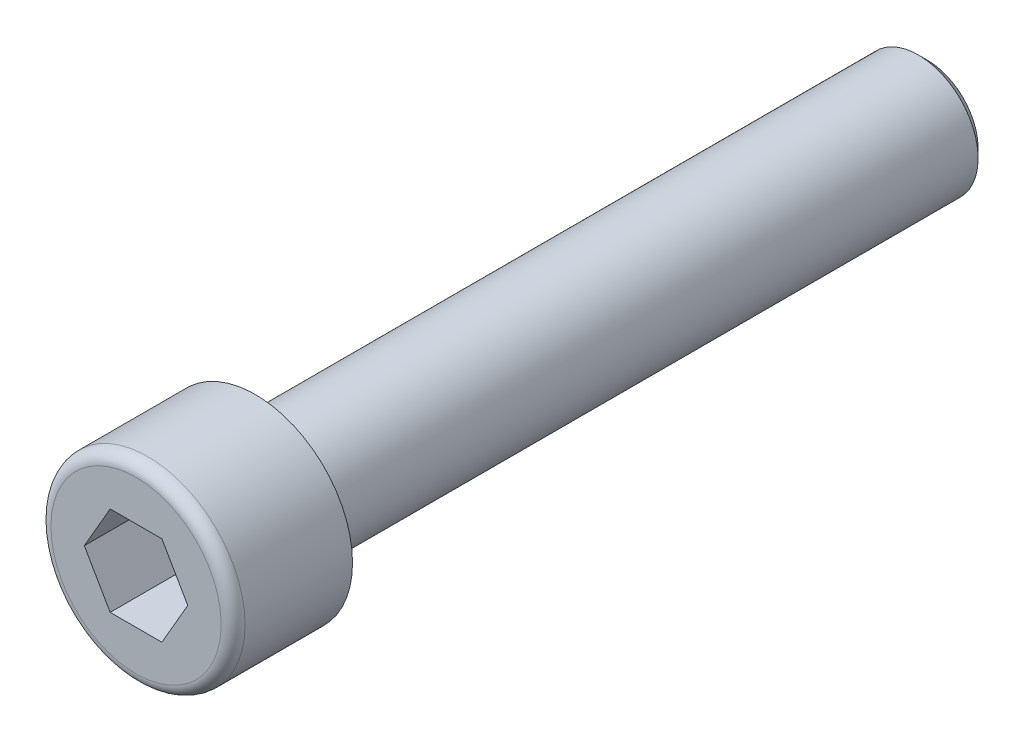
ISO-10303-21;
HEADER;
FILE_DESCRIPTION(('STEP AP214'),'2;1');
FILE_NAME('part.step','',(''),(''),'','','');
FILE_SCHEMA(('AUTOMOTIVE_DESIGN { 1 0 10303 214 1 1 1 1 }'));
ENDSEC;
DATA;
#1=APPLICATION_CONTEXT('core data for automotive mechanical design processes');
#2=APPLICATION_PROTOCOL_DEFINITION('international standard','automotive_design',2000,#1);
#3=PRODUCT_CONTEXT('',#1,'mechanical');
#4=PRODUCT('Part','Part','',(#3));
#5=PRODUCT_RELATED_PRODUCT_CATEGORY('part','',(#4));
#6=PRODUCT_DEFINITION_FORMATION('','',#4);
#7=PRODUCT_DEFINITION_CONTEXT('part definition',#1,'design');
#8=PRODUCT_DEFINITION('design','',#6,#7);
#9=PRODUCT_DEFINITION_SHAPE('','',#8);
#10=(LENGTH_UNIT() NAMED_UNIT(*) SI_UNIT(.MILLI.,.METRE.));
#11=(NAMED_UNIT(*) PLANE_ANGLE_UNIT() SI_UNIT($,.RADIAN.));
#12=(NAMED_UNIT(*) SI_UNIT($,.STERADIAN.) SOLID_ANGLE_UNIT());
#13=UNCERTAINTY_MEASURE_WITH_UNIT(LENGTH_MEASURE(1.E-05),#10,'distance_accuracy_value','');
#14=(GEOMETRIC_REPRESENTATION_CONTEXT(3) GLOBAL_UNCERTAINTY_ASSIGNED_CONTEXT((#13)) GLOBAL_UNIT_ASSIGNED_CONTEXT((#10,
#11,#12)) REPRESENTATION_CONTEXT('',''));
#15=CARTESIAN_POINT('',(0.,0.,0.));
#16=DIRECTION('',(0.,0.,1.));
#17=DIRECTION('',(1.,0.,0.));
#18=AXIS2_PLACEMENT_3D('',#15,#16,#17);
#19=CARTESIAN_POINT('',(0.,0.,8.));
#20=DIRECTION('',(0.,0.,1.));
#21=DIRECTION('',(1.,0.,0.));
#22=AXIS2_PLACEMENT_3D('',#19,#20,#21);
#23=PLANE('',#22);
#24=DIRECTION('',(0.500000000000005,-0.866025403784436,0.));
#25=VECTOR('',#24,1.);
#26=CARTESIAN_POINT('',(-2.59807621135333,-1.50000000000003,8.));
#27=LINE('',#26,#25);
#28=CARTESIAN_POINT('',(-3.4641016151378,0.,8.));
#29=VERTEX_POINT('',#28);
#30=CARTESIAN_POINT('',(-1.7320508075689,-3.,8.));
#31=VERTEX_POINT('',#30);
#32=EDGE_CURVE('E11',#29,#31,#27,.T.);
#33=ORIENTED_EDGE('',*,*,#32,.F.);
#34=DIRECTION('',(-0.500000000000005,-0.866025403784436,0.));
#35=VECTOR('',#34,1.);
#36=CARTESIAN_POINT('',(-2.59807621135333,1.50000000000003,8.));
#37=LINE('',#36,#35);
#38=CARTESIAN_POINT('',(-1.7320508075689,3.,8.));
#39=VERTEX_POINT('',#38);
#40=EDGE_CURVE('E39',#39,#29,#37,.T.);
#41=ORIENTED_EDGE('',*,*,#40,.F.);
#42=DIRECTION('',(-1.,0.,0.));
#43=VECTOR('',#42,1.);
#44=CARTESIAN_POINT('',(0.,3.,8.));
#45=LINE('',#44,#43);
#46=CARTESIAN_POINT('',(1.7320508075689,3.,8.));
#47=VERTEX_POINT('',#46);
#48=EDGE_CURVE('E147',#47,#39,#45,.T.);
#49=ORIENTED_EDGE('',*,*,#48,.F.);
#50=DIRECTION('',(-0.500000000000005,0.866025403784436,0.));
#51=VECTOR('',#50,1.);
#52=CARTESIAN_POINT('',(2.59807621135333,1.50000000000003,8.));
#53=LINE('',#52,#51);
#54=CARTESIAN_POINT('',(3.4641016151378,0.,8.));
#55=VERTEX_POINT('',#54);
#56=EDGE_CURVE('E145',#55,#47,#53,.T.);
#57=ORIENTED_EDGE('',*,*,#56,.F.);
#58=DIRECTION('',(0.500000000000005,0.866025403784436,0.));
#59=VECTOR('',#58,1.);
#60=CARTESIAN_POINT('',(2.59807621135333,-1.50000000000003,8.));
#61=LINE('',#60,#59);
#62=CARTESIAN_POINT('',(1.7320508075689,-3.,8.));
#63=VERTEX_POINT('',#62);
#64=EDGE_CURVE('E143',#63,#55,#61,.T.);
#65=ORIENTED_EDGE('',*,*,#64,.F.);
#66=DIRECTION('',(1.,0.,0.));
#67=VECTOR('',#66,1.);
#68=CARTESIAN_POINT('',(0.,-3.,8.));
#69=LINE('',#68,#67);
#70=EDGE_CURVE('E141',#31,#63,#69,.T.);
#71=ORIENTED_EDGE('',*,*,#70,.F.);
#72=EDGE_LOOP('',(#33,#41,#49,#57,#65,#71));
#73=FACE_BOUND('',#72,.T.);
#74=CARTESIAN_POINT('',(0.,0.,8.));
#75=DIRECTION('',(0.,0.,-1.));
#76=DIRECTION('',(-1.,0.,0.));
#77=AXIS2_PLACEMENT_3D('',#74,#75,#76);
#78=CIRCLE('',#77,5.7);
#79=CARTESIAN_POINT('',(-5.7,0.,8.));
#80=VERTEX_POINT('',#79);
#81=EDGE_CURVE('E138',#80,#80,#78,.T.);
#82=ORIENTED_EDGE('',*,*,#81,.F.);
#83=EDGE_LOOP('',(#82));
#84=FACE_BOUND('',#83,.T.);
#85=ADVANCED_FACE('F32',(#73,#84),#23,.T.);
#86=CARTESIAN_POINT('',(0.,0.,7.19999999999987));
#87=DIRECTION('',(0.,0.,-1.));
#88=DIRECTION('',(-1.,0.,0.));
#89=AXIS2_PLACEMENT_3D('',#86,#87,#88);
#90=TOROIDAL_SURFACE('',#89,5.69999999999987,0.80000000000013);
#91=ORIENTED_EDGE('',*,*,#81,.T.);
#92=EDGE_LOOP('',(#91));
#93=FACE_BOUND('',#92,.T.);
#94=CARTESIAN_POINT('',(0.,0.,7.2));
#95=DIRECTION('',(0.,0.,-1.));
#96=DIRECTION('',(-1.,0.,0.));
#97=AXIS2_PLACEMENT_3D('',#94,#95,#96);
#98=CIRCLE('',#97,6.5);
#99=CARTESIAN_POINT('',(-6.5,0.,7.2));
#100=VERTEX_POINT('',#99);
#101=EDGE_CURVE('E135',#100,#100,#98,.T.);
#102=ORIENTED_EDGE('',*,*,#101,.F.);
#103=EDGE_LOOP('',(#102));
#104=FACE_BOUND('',#103,.T.);
#105=ADVANCED_FACE('F171',(#93,#104),#90,.T.);
#106=CARTESIAN_POINT('',(0.,0.,-45.));
#107=DIRECTION('',(0.,0.,-1.));
#108=DIRECTION('',(-1.,0.,0.));
#109=AXIS2_PLACEMENT_3D('',#106,#107,#108);
#110=CYLINDRICAL_SURFACE('',#109,6.5);
#111=ORIENTED_EDGE('',*,*,#101,.T.);
#112=EDGE_LOOP('',(#111));
#113=FACE_BOUND('',#112,.T.);
#114=CARTESIAN_POINT('',(0.,0.,0.));
#115=DIRECTION('',(0.,0.,-1.));
#116=DIRECTION('',(-1.,0.,0.));
#117=AXIS2_PLACEMENT_3D('',#114,#115,#116);
#118=CIRCLE('',#117,6.5);
#119=CARTESIAN_POINT('',(-6.5,0.,0.));
#120=VERTEX_POINT('',#119);
#121=EDGE_CURVE('E132',#120,#120,#118,.T.);
#122=ORIENTED_EDGE('',*,*,#121,.F.);
#123=EDGE_LOOP('',(#122));
#124=FACE_BOUND('',#123,.T.);
#125=ADVANCED_FACE('F175',(#113,#124),#110,.T.);
#126=CARTESIAN_POINT('',(0.,6.5,0.));
#127=DIRECTION('',(0.,0.,-1.));
#128=DIRECTION('',(-1.,0.,0.));
#129=AXIS2_PLACEMENT_3D('',#126,#127,#128);
#130=PLANE('',#129);
#131=ORIENTED_EDGE('',*,*,#121,.T.);
#132=EDGE_LOOP('',(#131));
#133=FACE_BOUND('',#132,.T.);
#134=CARTESIAN_POINT('',(0.,0.,0.));
#135=DIRECTION('',(0.,0.,-1.));
#136=DIRECTION('',(-1.,0.,0.));
#137=AXIS2_PLACEMENT_3D('',#134,#135,#136);
#138=CIRCLE('',#137,4.);
#139=CARTESIAN_POINT('',(-4.,0.,0.));
#140=VERTEX_POINT('',#139);
#141=EDGE_CURVE('E129',#140,#140,#138,.T.);
#142=ORIENTED_EDGE('',*,*,#141,.F.);
#143=EDGE_LOOP('',(#142));
#144=FACE_BOUND('',#143,.T.);
#145=ADVANCED_FACE('F180',(#133,#144),#130,.T.);
#146=CARTESIAN_POINT('',(0.,0.,-45.));
#147=DIRECTION('',(0.,0.,-1.));
#148=DIRECTION('',(-1.,0.,0.));
#149=AXIS2_PLACEMENT_3D('',#146,#147,#148);
#150=CYLINDRICAL_SURFACE('',#149,4.);
#151=ORIENTED_EDGE('',*,*,#141,.T.);
#152=EDGE_LOOP('',(#151));
#153=FACE_BOUND('',#152,.T.);
#154=CARTESIAN_POINT('',(0.,0.,-44.4));
#155=DIRECTION('',(0.,0.,-1.));
#156=DIRECTION('',(-1.,0.,0.));
#157=AXIS2_PLACEMENT_3D('',#154,#155,#156);
#158=CIRCLE('',#157,4.);
#159=CARTESIAN_POINT('',(-4.,0.,-44.4));
#160=VERTEX_POINT('',#159);
#161=EDGE_CURVE('E126',#160,#160,#158,.T.);
#162=ORIENTED_EDGE('',*,*,#161,.F.);
#163=EDGE_LOOP('',(#162));
#164=FACE_BOUND('',#163,.T.);
#165=ADVANCED_FACE('F187',(#153,#164),#150,.T.);
#166=CARTESIAN_POINT('',(0.,0.,-45.));
#167=DIRECTION('',(0.,0.,1.));
#168=DIRECTION('',(1.,0.,0.));
#169=AXIS2_PLACEMENT_3D('',#166,#167,#168);
#170=CONICAL_SURFACE('',#169,3.4,0.785398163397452);
#171=ORIENTED_EDGE('',*,*,#161,.T.);
#172=EDGE_LOOP('',(#171));
#173=FACE_BOUND('',#172,.T.);
#174=CARTESIAN_POINT('',(0.,0.,-45.));
#175=DIRECTION('',(0.,0.,-1.));
#176=DIRECTION('',(-1.,0.,0.));
#177=AXIS2_PLACEMENT_3D('',#174,#175,#176);
#178=CIRCLE('',#177,3.4);
#179=CARTESIAN_POINT('',(-3.4,0.,-45.));
#180=VERTEX_POINT('',#179);
#181=EDGE_CURVE('E114',#180,#180,#178,.T.);
#182=ORIENTED_EDGE('',*,*,#181,.F.);
#183=EDGE_LOOP('',(#182));
#184=FACE_BOUND('',#183,.T.);
#185=ADVANCED_FACE('F191',(#173,#184),#170,.T.);
#186=CARTESIAN_POINT('',(0.,3.4,-45.));
#187=DIRECTION('',(0.,0.,-1.));
#188=DIRECTION('',(-1.,0.,0.));
#189=AXIS2_PLACEMENT_3D('',#186,#187,#188);
#190=PLANE('',#189);
#191=ORIENTED_EDGE('',*,*,#181,.T.);
#192=EDGE_LOOP('',(#191));
#193=FACE_BOUND('',#192,.T.);
#194=ADVANCED_FACE('F195',(#193),#190,.T.);
#195=CARTESIAN_POINT('',(-3.4641016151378,0.,3.));
#196=DIRECTION('',(-0.866025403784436,-0.500000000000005,0.));
#197=DIRECTION('',(0.500000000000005,-0.866025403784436,0.));
#198=AXIS2_PLACEMENT_3D('',#195,#196,#197);
#199=PLANE('',#198);
#200=ORIENTED_EDGE('',*,*,#32,.T.);
#201=DIRECTION('',(0.,0.,1.));
#202=VECTOR('',#201,1.);
#203=CARTESIAN_POINT('',(-1.7320508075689,-3.,3.));
#204=LINE('',#203,#202);
#205=CARTESIAN_POINT('',(-1.7320508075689,-3.,3.));
#206=VERTEX_POINT('',#205);
#207=EDGE_CURVE('E46',#206,#31,#204,.T.);
#208=ORIENTED_EDGE('',*,*,#207,.F.);
#209=DIRECTION('',(0.500000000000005,-0.866025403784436,0.));
#210=VECTOR('',#209,1.);
#211=CARTESIAN_POINT('',(-3.4641016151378,0.,3.));
#212=LINE('',#211,#210);
#213=CARTESIAN_POINT('',(-3.4641016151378,0.,3.));
#214=VERTEX_POINT('',#213);
#215=EDGE_CURVE('E84',#214,#206,#212,.T.);
#216=ORIENTED_EDGE('',*,*,#215,.F.);
#217=DIRECTION('',(0.,0.,1.));
#218=VECTOR('',#217,1.);
#219=CARTESIAN_POINT('',(-3.4641016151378,0.,3.));
#220=LINE('',#219,#218);
#221=EDGE_CURVE('E112',#214,#29,#220,.T.);
#222=ORIENTED_EDGE('',*,*,#221,.T.);
#223=EDGE_LOOP('',(#200,#208,#216,#222));
#224=FACE_BOUND('',#223,.T.);
#225=ADVANCED_FACE('F82',(#224),#199,.F.);
#226=CARTESIAN_POINT('',(-1.7320508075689,3.,3.));
#227=DIRECTION('',(-0.866025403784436,0.500000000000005,0.));
#228=DIRECTION('',(-0.500000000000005,-0.866025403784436,0.));
#229=AXIS2_PLACEMENT_3D('',#226,#227,#228);
#230=PLANE('',#229);
#231=ORIENTED_EDGE('',*,*,#40,.T.);
#232=ORIENTED_EDGE('',*,*,#221,.F.);
#233=DIRECTION('',(-0.500000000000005,-0.866025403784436,0.));
#234=VECTOR('',#233,1.);
#235=CARTESIAN_POINT('',(-1.7320508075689,3.,3.));
#236=LINE('',#235,#234);
#237=CARTESIAN_POINT('',(-1.7320508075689,3.,3.));
#238=VERTEX_POINT('',#237);
#239=EDGE_CURVE('E89',#238,#214,#236,.T.);
#240=ORIENTED_EDGE('',*,*,#239,.F.);
#241=DIRECTION('',(0.,0.,1.));
#242=VECTOR('',#241,1.);
#243=CARTESIAN_POINT('',(-1.7320508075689,3.,3.));
#244=LINE('',#243,#242);
#245=EDGE_CURVE('E115',#238,#39,#244,.T.);
#246=ORIENTED_EDGE('',*,*,#245,.T.);
#247=EDGE_LOOP('',(#231,#232,#240,#246));
#248=FACE_BOUND('',#247,.T.);
#249=ADVANCED_FACE('F154',(#248),#230,.F.);
#250=CARTESIAN_POINT('',(1.7320508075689,3.,3.));
#251=DIRECTION('',(0.,1.,0.));
#252=DIRECTION('',(0.,0.,1.));
#253=AXIS2_PLACEMENT_3D('',#250,#251,#252);
#254=PLANE('',#253);
#255=ORIENTED_EDGE('',*,*,#48,.T.);
#256=ORIENTED_EDGE('',*,*,#245,.F.);
#257=DIRECTION('',(-1.,0.,0.));
#258=VECTOR('',#257,1.);
#259=CARTESIAN_POINT('',(1.7320508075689,3.,3.));
#260=LINE('',#259,#258);
#261=CARTESIAN_POINT('',(1.7320508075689,3.,3.));
#262=VERTEX_POINT('',#261);
#263=EDGE_CURVE('E109',#262,#238,#260,.T.);
#264=ORIENTED_EDGE('',*,*,#263,.F.);
#265=DIRECTION('',(0.,0.,1.));
#266=VECTOR('',#265,1.);
#267=CARTESIAN_POINT('',(1.7320508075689,3.,3.));
#268=LINE('',#267,#266);
#269=EDGE_CURVE('E117',#262,#47,#268,.T.);
#270=ORIENTED_EDGE('',*,*,#269,.T.);
#271=EDGE_LOOP('',(#255,#256,#264,#270));
#272=FACE_BOUND('',#271,.T.);
#273=ADVANCED_FACE('F150',(#272),#254,.F.);
#274=CARTESIAN_POINT('',(3.4641016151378,0.,3.));
#275=DIRECTION('',(0.866025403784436,0.500000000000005,0.));
#276=DIRECTION('',(-0.500000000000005,0.866025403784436,0.));
#277=AXIS2_PLACEMENT_3D('',#274,#275,#276);
#278=PLANE('',#277);
#279=ORIENTED_EDGE('',*,*,#56,.T.);
#280=ORIENTED_EDGE('',*,*,#269,.F.);
#281=DIRECTION('',(-0.500000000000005,0.866025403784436,0.));
#282=VECTOR('',#281,1.);
#283=CARTESIAN_POINT('',(3.4641016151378,0.,3.));
#284=LINE('',#283,#282);
#285=CARTESIAN_POINT('',(3.4641016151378,0.,3.));
#286=VERTEX_POINT('',#285);
#287=EDGE_CURVE('E106',#286,#262,#284,.T.);
#288=ORIENTED_EDGE('',*,*,#287,.F.);
#289=DIRECTION('',(0.,0.,1.));
#290=VECTOR('',#289,1.);
#291=CARTESIAN_POINT('',(3.4641016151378,0.,3.));
#292=LINE('',#291,#290);
#293=EDGE_CURVE('E120',#286,#55,#292,.T.);
#294=ORIENTED_EDGE('',*,*,#293,.T.);
#295=EDGE_LOOP('',(#279,#280,#288,#294));
#296=FACE_BOUND('',#295,.T.);
#297=ADVANCED_FACE('F161',(#296),#278,.F.);
#298=CARTESIAN_POINT('',(1.7320508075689,-3.,3.));
#299=DIRECTION('',(0.866025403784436,-0.500000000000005,0.));
#300=DIRECTION('',(0.500000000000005,0.866025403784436,0.));
#301=AXIS2_PLACEMENT_3D('',#298,#299,#300);
#302=PLANE('',#301);
#303=ORIENTED_EDGE('',*,*,#64,.T.);
#304=ORIENTED_EDGE('',*,*,#293,.F.);
#305=DIRECTION('',(0.500000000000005,0.866025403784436,0.));
#306=VECTOR('',#305,1.);
#307=CARTESIAN_POINT('',(1.7320508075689,-3.,3.));
#308=LINE('',#307,#306);
#309=CARTESIAN_POINT('',(1.7320508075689,-3.,3.));
#310=VERTEX_POINT('',#309);
#311=EDGE_CURVE('E98',#310,#286,#308,.T.);
#312=ORIENTED_EDGE('',*,*,#311,.F.);
#313=DIRECTION('',(0.,0.,1.));
#314=VECTOR('',#313,1.);
#315=CARTESIAN_POINT('',(1.7320508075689,-3.,3.));
#316=LINE('',#315,#314);
#317=EDGE_CURVE('E88',#310,#63,#316,.T.);
#318=ORIENTED_EDGE('',*,*,#317,.T.);
#319=EDGE_LOOP('',(#303,#304,#312,#318));
#320=FACE_BOUND('',#319,.T.);
#321=ADVANCED_FACE('F158',(#320),#302,.F.);
#322=CARTESIAN_POINT('',(-1.7320508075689,-3.,3.));
#323=DIRECTION('',(0.,-1.,0.));
#324=DIRECTION('',(0.,0.,-1.));
#325=AXIS2_PLACEMENT_3D('',#322,#323,#324);
#326=PLANE('',#325);
#327=ORIENTED_EDGE('',*,*,#70,.T.);
#328=ORIENTED_EDGE('',*,*,#317,.F.);
#329=DIRECTION('',(1.,0.,0.));
#330=VECTOR('',#329,1.);
#331=CARTESIAN_POINT('',(-1.7320508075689,-3.,3.));
#332=LINE('',#331,#330);
#333=EDGE_CURVE('E92',#206,#310,#332,.T.);
#334=ORIENTED_EDGE('',*,*,#333,.F.);
#335=ORIENTED_EDGE('',*,*,#207,.T.);
#336=EDGE_LOOP('',(#327,#328,#334,#335));
#337=FACE_BOUND('',#336,.T.);
#338=ADVANCED_FACE('F93',(#337),#326,.F.);
#339=CARTESIAN_POINT('',(0.,-6.,3.));
#340=DIRECTION('',(0.,0.,1.));
#341=DIRECTION('',(1.,0.,0.));
#342=AXIS2_PLACEMENT_3D('',#339,#340,#341);
#343=PLANE('',#342);
#344=ORIENTED_EDGE('',*,*,#215,.T.);
#345=ORIENTED_EDGE('',*,*,#333,.T.);
#346=ORIENTED_EDGE('',*,*,#311,.T.);
#347=ORIENTED_EDGE('',*,*,#287,.T.);
#348=ORIENTED_EDGE('',*,*,#263,.T.);
#349=ORIENTED_EDGE('',*,*,#239,.T.);
#350=EDGE_LOOP('',(#344,#345,#346,#347,#348,#349));
#351=FACE_BOUND('',#350,.T.);
#352=ADVANCED_FACE('F100',(#351),#343,.T.);
#353=CLOSED_SHELL('',(#85,#105,#125,#145,#165,#185,#194,#225,#249,#273,#297,#321,#338,#352));
#354=MANIFOLD_SOLID_BREP('B2',#353);
#355=ADVANCED_BREP_SHAPE_REPRESENTATION('',(#18,#354),#14);
#356=SHAPE_DEFINITION_REPRESENTATION(#9,#355);
ENDSEC;
END-ISO-10303-21;
